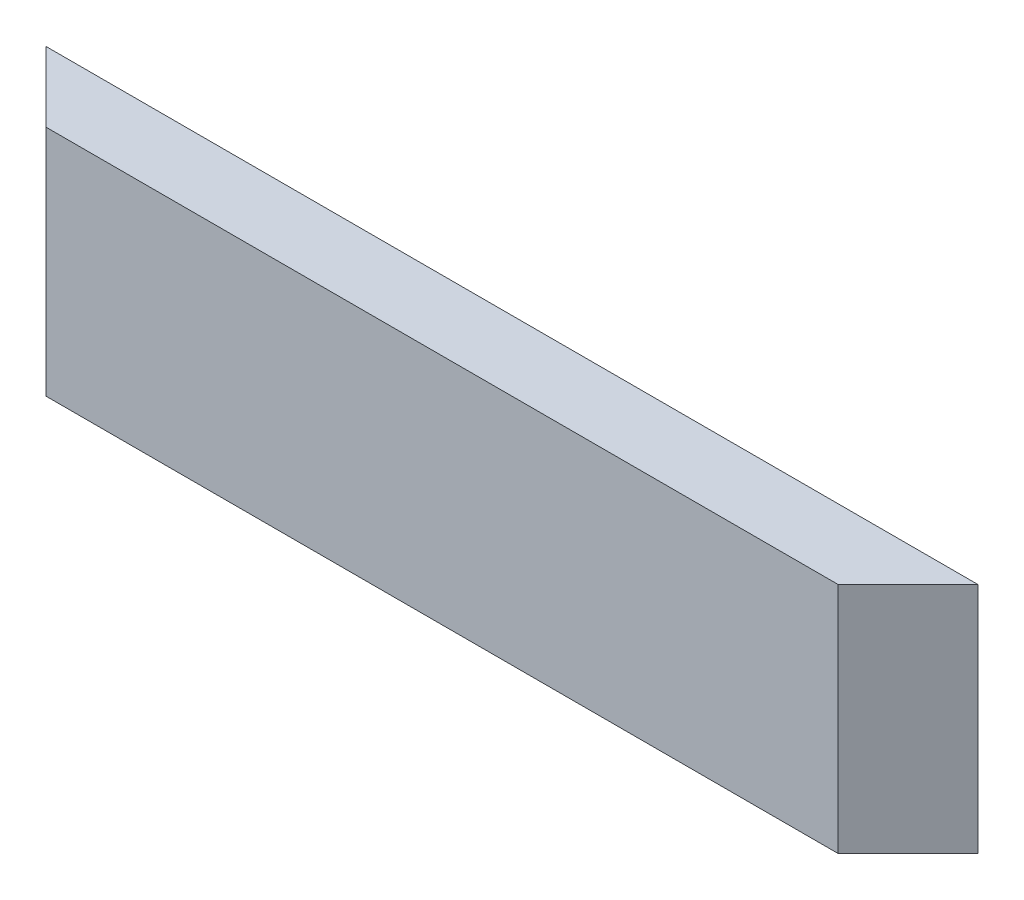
ISO-10303-21;
HEADER;
FILE_DESCRIPTION(('STEP AP214'),'2;1');
FILE_NAME('part.step','',(''),(''),'','','');
FILE_SCHEMA(('AUTOMOTIVE_DESIGN { 1 0 10303 214 1 1 1 1 }'));
ENDSEC;
DATA;
#1=APPLICATION_CONTEXT('core data for automotive mechanical design processes');
#2=APPLICATION_PROTOCOL_DEFINITION('international standard','automotive_design',2000,#1);
#3=PRODUCT_CONTEXT('',#1,'mechanical');
#4=PRODUCT('Part','Part','',(#3));
#5=PRODUCT_RELATED_PRODUCT_CATEGORY('part','',(#4));
#6=PRODUCT_DEFINITION_FORMATION('','',#4);
#7=PRODUCT_DEFINITION_CONTEXT('part definition',#1,'design');
#8=PRODUCT_DEFINITION('design','',#6,#7);
#9=PRODUCT_DEFINITION_SHAPE('','',#8);
#10=(LENGTH_UNIT() NAMED_UNIT(*) SI_UNIT(.MILLI.,.METRE.));
#11=(NAMED_UNIT(*) PLANE_ANGLE_UNIT() SI_UNIT($,.RADIAN.));
#12=(NAMED_UNIT(*) SI_UNIT($,.STERADIAN.) SOLID_ANGLE_UNIT());
#13=UNCERTAINTY_MEASURE_WITH_UNIT(LENGTH_MEASURE(1.E-05),#10,'distance_accuracy_value','');
#14=(GEOMETRIC_REPRESENTATION_CONTEXT(3) GLOBAL_UNCERTAINTY_ASSIGNED_CONTEXT((#13)) GLOBAL_UNIT_ASSIGNED_CONTEXT((#10,
#11,#12)) REPRESENTATION_CONTEXT('',''));
#15=CARTESIAN_POINT('',(0.,0.,0.));
#16=DIRECTION('',(0.,0.,1.));
#17=DIRECTION('',(1.,0.,0.));
#18=AXIS2_PLACEMENT_3D('',#15,#16,#17);
#19=CARTESIAN_POINT('',(-9.99999999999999,2.5,1.5));
#20=DIRECTION('',(0.,-1.,0.));
#21=DIRECTION('',(0.,0.,-1.));
#22=AXIS2_PLACEMENT_3D('',#19,#20,#21);
#23=PLANE('',#22);
#24=DIRECTION('',(-1.,0.,0.));
#25=VECTOR('',#24,1.);
#26=CARTESIAN_POINT('',(-9.99999999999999,2.5,0.));
#27=LINE('',#26,#25);
#28=CARTESIAN_POINT('',(10.,2.5,0.));
#29=VERTEX_POINT('',#28);
#30=CARTESIAN_POINT('',(-9.99999999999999,2.5,0.));
#31=VERTEX_POINT('',#30);
#32=EDGE_CURVE('E73',#29,#31,#27,.T.);
#33=ORIENTED_EDGE('',*,*,#32,.T.);
#34=DIRECTION('',(-0.707106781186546,0.,-0.707106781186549));
#35=VECTOR('',#34,1.);
#36=CARTESIAN_POINT('',(-8.49999999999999,2.5,1.5));
#37=LINE('',#36,#35);
#38=CARTESIAN_POINT('',(-8.49999999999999,2.5,1.5));
#39=VERTEX_POINT('',#38);
#40=EDGE_CURVE('E11',#31,#39,#37,.F.);
#41=ORIENTED_EDGE('',*,*,#40,.T.);
#42=DIRECTION('',(-1.,0.,0.));
#43=VECTOR('',#42,1.);
#44=CARTESIAN_POINT('',(-9.99999999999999,2.5,1.5));
#45=LINE('',#44,#43);
#46=CARTESIAN_POINT('',(8.50000000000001,2.5,1.5));
#47=VERTEX_POINT('',#46);
#48=EDGE_CURVE('E76',#47,#39,#45,.T.);
#49=ORIENTED_EDGE('',*,*,#48,.F.);
#50=DIRECTION('',(-0.707106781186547,0.,0.707106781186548));
#51=VECTOR('',#50,1.);
#52=CARTESIAN_POINT('',(8.50000000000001,2.5,1.5));
#53=LINE('',#52,#51);
#54=EDGE_CURVE('E39',#47,#29,#53,.F.);
#55=ORIENTED_EDGE('',*,*,#54,.T.);
#56=EDGE_LOOP('',(#33,#41,#49,#55));
#57=FACE_BOUND('',#56,.T.);
#58=ADVANCED_FACE('F31',(#57),#23,.F.);
#59=CARTESIAN_POINT('',(-9.99999999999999,-2.5,1.5));
#60=DIRECTION('',(0.,1.,0.));
#61=DIRECTION('',(0.,0.,1.));
#62=AXIS2_PLACEMENT_3D('',#59,#60,#61);
#63=PLANE('',#62);
#64=DIRECTION('',(1.,0.,0.));
#65=VECTOR('',#64,1.);
#66=CARTESIAN_POINT('',(-9.99999999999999,-2.5,1.5));
#67=LINE('',#66,#65);
#68=CARTESIAN_POINT('',(-8.49999999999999,-2.5,1.5));
#69=VERTEX_POINT('',#68);
#70=CARTESIAN_POINT('',(8.50000000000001,-2.5,1.5));
#71=VERTEX_POINT('',#70);
#72=EDGE_CURVE('E91',#69,#71,#67,.T.);
#73=ORIENTED_EDGE('',*,*,#72,.F.);
#74=DIRECTION('',(0.707106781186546,0.,0.707106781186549));
#75=VECTOR('',#74,1.);
#76=CARTESIAN_POINT('',(-8.49999999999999,-2.5,1.5));
#77=LINE('',#76,#75);
#78=CARTESIAN_POINT('',(-9.99999999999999,-2.5,0.));
#79=VERTEX_POINT('',#78);
#80=EDGE_CURVE('E54',#69,#79,#77,.F.);
#81=ORIENTED_EDGE('',*,*,#80,.T.);
#82=DIRECTION('',(1.,0.,0.));
#83=VECTOR('',#82,1.);
#84=CARTESIAN_POINT('',(-9.99999999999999,-2.5,0.));
#85=LINE('',#84,#83);
#86=CARTESIAN_POINT('',(10.,-2.5,0.));
#87=VERTEX_POINT('',#86);
#88=EDGE_CURVE('E95',#79,#87,#85,.T.);
#89=ORIENTED_EDGE('',*,*,#88,.T.);
#90=DIRECTION('',(0.707106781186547,0.,-0.707106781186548));
#91=VECTOR('',#90,1.);
#92=CARTESIAN_POINT('',(8.50000000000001,-2.5,1.5));
#93=LINE('',#92,#91);
#94=EDGE_CURVE('E46',#87,#71,#93,.F.);
#95=ORIENTED_EDGE('',*,*,#94,.T.);
#96=EDGE_LOOP('',(#73,#81,#89,#95));
#97=FACE_BOUND('',#96,.T.);
#98=ADVANCED_FACE('F102',(#97),#63,.F.);
#99=CARTESIAN_POINT('',(10.,2.5,1.5));
#100=DIRECTION('',(0.,0.,-1.));
#101=DIRECTION('',(-1.,0.,0.));
#102=AXIS2_PLACEMENT_3D('',#99,#100,#101);
#103=PLANE('',#102);
#104=ORIENTED_EDGE('',*,*,#48,.T.);
#105=DIRECTION('',(0.,-1.,0.));
#106=VECTOR('',#105,1.);
#107=CARTESIAN_POINT('',(-8.49999999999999,2.5,1.5));
#108=LINE('',#107,#106);
#109=EDGE_CURVE('E99',#39,#69,#108,.T.);
#110=ORIENTED_EDGE('',*,*,#109,.T.);
#111=ORIENTED_EDGE('',*,*,#72,.T.);
#112=DIRECTION('',(0.,1.,0.));
#113=VECTOR('',#112,1.);
#114=CARTESIAN_POINT('',(8.50000000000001,2.5,1.5));
#115=LINE('',#114,#113);
#116=EDGE_CURVE('E97',#71,#47,#115,.T.);
#117=ORIENTED_EDGE('',*,*,#116,.T.);
#118=EDGE_LOOP('',(#104,#110,#111,#117));
#119=FACE_BOUND('',#118,.T.);
#120=ADVANCED_FACE('F105',(#119),#103,.F.);
#121=CARTESIAN_POINT('',(10.,2.5,0.));
#122=DIRECTION('',(0.,0.,-1.));
#123=DIRECTION('',(-1.,0.,0.));
#124=AXIS2_PLACEMENT_3D('',#121,#122,#123);
#125=PLANE('',#124);
#126=DIRECTION('',(0.,1.,0.));
#127=VECTOR('',#126,1.);
#128=CARTESIAN_POINT('',(10.,-2.5,0.));
#129=LINE('',#128,#127);
#130=EDGE_CURVE('E85',#87,#29,#129,.T.);
#131=ORIENTED_EDGE('',*,*,#130,.F.);
#132=ORIENTED_EDGE('',*,*,#88,.F.);
#133=DIRECTION('',(0.,-1.,0.));
#134=VECTOR('',#133,1.);
#135=CARTESIAN_POINT('',(-9.99999999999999,-2.5,0.));
#136=LINE('',#135,#134);
#137=EDGE_CURVE('E86',#31,#79,#136,.T.);
#138=ORIENTED_EDGE('',*,*,#137,.F.);
#139=ORIENTED_EDGE('',*,*,#32,.F.);
#140=EDGE_LOOP('',(#131,#132,#138,#139));
#141=FACE_BOUND('',#140,.T.);
#142=ADVANCED_FACE('F83',(#141),#125,.T.);
#143=CARTESIAN_POINT('',(-8.49999999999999,2.5,1.5));
#144=DIRECTION('',(0.707106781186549,0.,-0.707106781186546));
#145=DIRECTION('',(-0.707106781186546,0.,-0.707106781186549));
#146=AXIS2_PLACEMENT_3D('',#143,#144,#145);
#147=PLANE('',#146);
#148=ORIENTED_EDGE('',*,*,#40,.F.);
#149=ORIENTED_EDGE('',*,*,#137,.T.);
#150=ORIENTED_EDGE('',*,*,#80,.F.);
#151=ORIENTED_EDGE('',*,*,#109,.F.);
#152=EDGE_LOOP('',(#148,#149,#150,#151));
#153=FACE_BOUND('',#152,.T.);
#154=ADVANCED_FACE('F103',(#153),#147,.F.);
#155=CARTESIAN_POINT('',(8.50000000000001,2.5,1.5));
#156=DIRECTION('',(-0.707106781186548,0.,-0.707106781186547));
#157=DIRECTION('',(-0.707106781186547,0.,0.707106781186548));
#158=AXIS2_PLACEMENT_3D('',#155,#156,#157);
#159=PLANE('',#158);
#160=ORIENTED_EDGE('',*,*,#94,.F.);
#161=ORIENTED_EDGE('',*,*,#130,.T.);
#162=ORIENTED_EDGE('',*,*,#54,.F.);
#163=ORIENTED_EDGE('',*,*,#116,.F.);
#164=EDGE_LOOP('',(#160,#161,#162,#163));
#165=FACE_BOUND('',#164,.T.);
#166=ADVANCED_FACE('F33',(#165),#159,.F.);
#167=CLOSED_SHELL('',(#58,#98,#120,#142,#154,#166));
#168=MANIFOLD_SOLID_BREP('B2',#167);
#169=ADVANCED_BREP_SHAPE_REPRESENTATION('',(#18,#168),#14);
#170=SHAPE_DEFINITION_REPRESENTATION(#9,#169);
ENDSEC;
END-ISO-10303-21;
